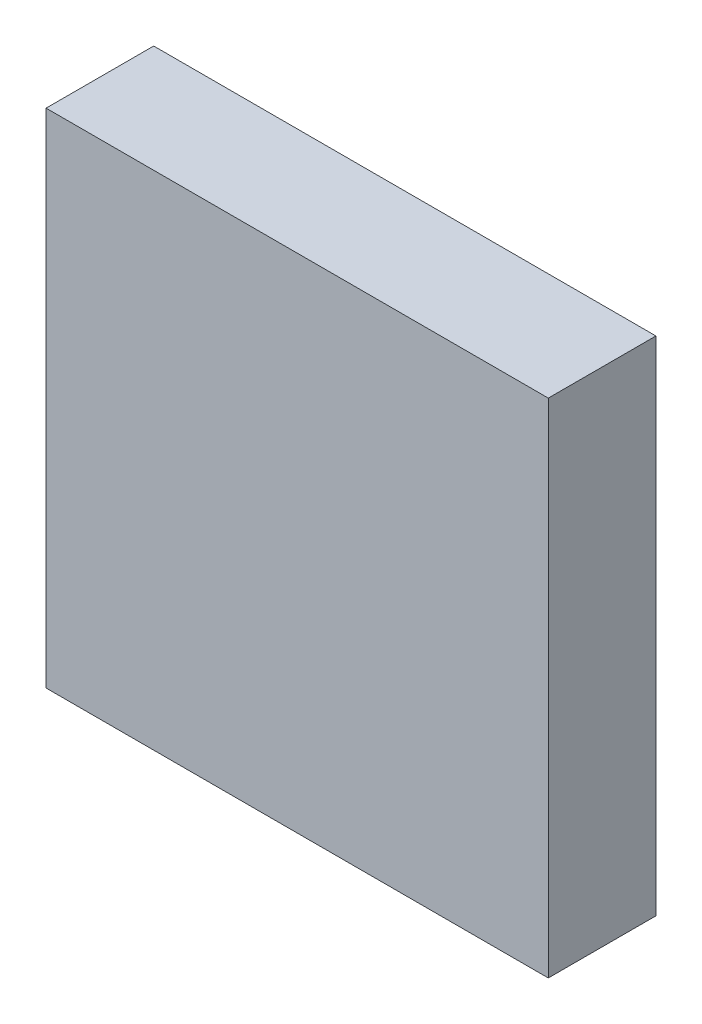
ISO-10303-21;
HEADER;
FILE_DESCRIPTION(('STEP AP214'),'2;1');
FILE_NAME('part.step','',(''),(''),'','','');
FILE_SCHEMA(('AUTOMOTIVE_DESIGN { 1 0 10303 214 1 1 1 1 }'));
ENDSEC;
DATA;
#1=APPLICATION_CONTEXT('core data for automotive mechanical design processes');
#2=APPLICATION_PROTOCOL_DEFINITION('international standard','automotive_design',2000,#1);
#3=PRODUCT_CONTEXT('',#1,'mechanical');
#4=PRODUCT('Part','Part','',(#3));
#5=PRODUCT_RELATED_PRODUCT_CATEGORY('part','',(#4));
#6=PRODUCT_DEFINITION_FORMATION('','',#4);
#7=PRODUCT_DEFINITION_CONTEXT('part definition',#1,'design');
#8=PRODUCT_DEFINITION('design','',#6,#7);
#9=PRODUCT_DEFINITION_SHAPE('','',#8);
#10=(LENGTH_UNIT() NAMED_UNIT(*) SI_UNIT(.MILLI.,.METRE.));
#11=(NAMED_UNIT(*) PLANE_ANGLE_UNIT() SI_UNIT($,.RADIAN.));
#12=(NAMED_UNIT(*) SI_UNIT($,.STERADIAN.) SOLID_ANGLE_UNIT());
#13=UNCERTAINTY_MEASURE_WITH_UNIT(LENGTH_MEASURE(1.E-05),#10,'distance_accuracy_value','');
#14=(GEOMETRIC_REPRESENTATION_CONTEXT(3) GLOBAL_UNCERTAINTY_ASSIGNED_CONTEXT((#13)) GLOBAL_UNIT_ASSIGNED_CONTEXT((#10,
#11,#12)) REPRESENTATION_CONTEXT('',''));
#15=CARTESIAN_POINT('',(0.,0.,0.));
#16=DIRECTION('',(0.,0.,1.));
#17=DIRECTION('',(1.,0.,0.));
#18=AXIS2_PLACEMENT_3D('',#15,#16,#17);
#19=CARTESIAN_POINT('',(-7.,7.,3.));
#20=DIRECTION('',(1.,0.,0.));
#21=DIRECTION('',(0.,1.,0.));
#22=AXIS2_PLACEMENT_3D('',#19,#20,#21);
#23=PLANE('',#22);
#24=DIRECTION('',(0.,-1.,0.));
#25=VECTOR('',#24,1.);
#26=CARTESIAN_POINT('',(-7.,7.,0.));
#27=LINE('',#26,#25);
#28=CARTESIAN_POINT('',(-7.,7.,0.));
#29=VERTEX_POINT('',#28);
#30=CARTESIAN_POINT('',(-7.,-7.,0.));
#31=VERTEX_POINT('',#30);
#32=EDGE_CURVE('E76',#29,#31,#27,.T.);
#33=ORIENTED_EDGE('',*,*,#32,.T.);
#34=DIRECTION('',(0.,0.,-1.));
#35=VECTOR('',#34,1.);
#36=CARTESIAN_POINT('',(-7.,-7.,3.));
#37=LINE('',#36,#35);
#38=CARTESIAN_POINT('',(-7.,-7.,3.));
#39=VERTEX_POINT('',#38);
#40=EDGE_CURVE('E11',#39,#31,#37,.T.);
#41=ORIENTED_EDGE('',*,*,#40,.F.);
#42=DIRECTION('',(0.,-1.,0.));
#43=VECTOR('',#42,1.);
#44=CARTESIAN_POINT('',(-7.,7.,3.));
#45=LINE('',#44,#43);
#46=CARTESIAN_POINT('',(-7.,7.,3.));
#47=VERTEX_POINT('',#46);
#48=EDGE_CURVE('E94',#47,#39,#45,.T.);
#49=ORIENTED_EDGE('',*,*,#48,.F.);
#50=DIRECTION('',(0.,0.,-1.));
#51=VECTOR('',#50,1.);
#52=CARTESIAN_POINT('',(-7.,7.,3.));
#53=LINE('',#52,#51);
#54=EDGE_CURVE('E88',#47,#29,#53,.T.);
#55=ORIENTED_EDGE('',*,*,#54,.T.);
#56=EDGE_LOOP('',(#33,#41,#49,#55));
#57=FACE_BOUND('',#56,.T.);
#58=ADVANCED_FACE('F32',(#57),#23,.F.);
#59=CARTESIAN_POINT('',(-7.,-7.,3.));
#60=DIRECTION('',(0.,1.,0.));
#61=DIRECTION('',(0.,0.,1.));
#62=AXIS2_PLACEMENT_3D('',#59,#60,#61);
#63=PLANE('',#62);
#64=DIRECTION('',(1.,0.,0.));
#65=VECTOR('',#64,1.);
#66=CARTESIAN_POINT('',(-7.,-7.,0.));
#67=LINE('',#66,#65);
#68=CARTESIAN_POINT('',(7.,-7.,0.));
#69=VERTEX_POINT('',#68);
#70=EDGE_CURVE('E72',#31,#69,#67,.T.);
#71=ORIENTED_EDGE('',*,*,#70,.T.);
#72=DIRECTION('',(0.,0.,-1.));
#73=VECTOR('',#72,1.);
#74=CARTESIAN_POINT('',(7.,-7.,3.));
#75=LINE('',#74,#73);
#76=CARTESIAN_POINT('',(7.,-7.,3.));
#77=VERTEX_POINT('',#76);
#78=EDGE_CURVE('E39',#77,#69,#75,.T.);
#79=ORIENTED_EDGE('',*,*,#78,.F.);
#80=DIRECTION('',(1.,0.,0.));
#81=VECTOR('',#80,1.);
#82=CARTESIAN_POINT('',(-7.,-7.,3.));
#83=LINE('',#82,#81);
#84=EDGE_CURVE('E84',#39,#77,#83,.T.);
#85=ORIENTED_EDGE('',*,*,#84,.F.);
#86=ORIENTED_EDGE('',*,*,#40,.T.);
#87=EDGE_LOOP('',(#71,#79,#85,#86));
#88=FACE_BOUND('',#87,.T.);
#89=ADVANCED_FACE('F83',(#88),#63,.F.);
#90=CARTESIAN_POINT('',(7.,7.,3.));
#91=DIRECTION('',(-1.,0.,0.));
#92=DIRECTION('',(0.,-1.,0.));
#93=AXIS2_PLACEMENT_3D('',#90,#91,#92);
#94=PLANE('',#93);
#95=DIRECTION('',(0.,1.,0.));
#96=VECTOR('',#95,1.);
#97=CARTESIAN_POINT('',(7.,7.,0.));
#98=LINE('',#97,#96);
#99=CARTESIAN_POINT('',(7.,7.,0.));
#100=VERTEX_POINT('',#99);
#101=EDGE_CURVE('E77',#69,#100,#98,.T.);
#102=ORIENTED_EDGE('',*,*,#101,.T.);
#103=DIRECTION('',(0.,0.,-1.));
#104=VECTOR('',#103,1.);
#105=CARTESIAN_POINT('',(7.,7.,3.));
#106=LINE('',#105,#104);
#107=CARTESIAN_POINT('',(7.,7.,3.));
#108=VERTEX_POINT('',#107);
#109=EDGE_CURVE('E100',#108,#100,#106,.T.);
#110=ORIENTED_EDGE('',*,*,#109,.F.);
#111=DIRECTION('',(0.,1.,0.));
#112=VECTOR('',#111,1.);
#113=CARTESIAN_POINT('',(7.,7.,3.));
#114=LINE('',#113,#112);
#115=EDGE_CURVE('E51',#77,#108,#114,.T.);
#116=ORIENTED_EDGE('',*,*,#115,.F.);
#117=ORIENTED_EDGE('',*,*,#78,.T.);
#118=EDGE_LOOP('',(#102,#110,#116,#117));
#119=FACE_BOUND('',#118,.T.);
#120=ADVANCED_FACE('F103',(#119),#94,.F.);
#121=CARTESIAN_POINT('',(-7.,7.,3.));
#122=DIRECTION('',(0.,-1.,0.));
#123=DIRECTION('',(1.,0.,0.));
#124=AXIS2_PLACEMENT_3D('',#121,#122,#123);
#125=PLANE('',#124);
#126=DIRECTION('',(-1.,0.,0.));
#127=VECTOR('',#126,1.);
#128=CARTESIAN_POINT('',(-7.,7.,0.));
#129=LINE('',#128,#127);
#130=EDGE_CURVE('E92',#100,#29,#129,.T.);
#131=ORIENTED_EDGE('',*,*,#130,.T.);
#132=ORIENTED_EDGE('',*,*,#54,.F.);
#133=DIRECTION('',(-1.,0.,0.));
#134=VECTOR('',#133,1.);
#135=CARTESIAN_POINT('',(-7.,7.,3.));
#136=LINE('',#135,#134);
#137=EDGE_CURVE('E46',#108,#47,#136,.T.);
#138=ORIENTED_EDGE('',*,*,#137,.F.);
#139=ORIENTED_EDGE('',*,*,#109,.T.);
#140=EDGE_LOOP('',(#131,#132,#138,#139));
#141=FACE_BOUND('',#140,.T.);
#142=ADVANCED_FACE('F105',(#141),#125,.F.);
#143=CARTESIAN_POINT('',(-7.,-7.,3.));
#144=DIRECTION('',(0.,0.,1.));
#145=DIRECTION('',(1.,0.,0.));
#146=AXIS2_PLACEMENT_3D('',#143,#144,#145);
#147=PLANE('',#146);
#148=ORIENTED_EDGE('',*,*,#48,.T.);
#149=ORIENTED_EDGE('',*,*,#84,.T.);
#150=ORIENTED_EDGE('',*,*,#115,.T.);
#151=ORIENTED_EDGE('',*,*,#137,.T.);
#152=EDGE_LOOP('',(#148,#149,#150,#151));
#153=FACE_BOUND('',#152,.T.);
#154=ADVANCED_FACE('F106',(#153),#147,.T.);
#155=CARTESIAN_POINT('',(-7.,-7.,0.));
#156=DIRECTION('',(0.,0.,1.));
#157=DIRECTION('',(1.,0.,0.));
#158=AXIS2_PLACEMENT_3D('',#155,#156,#157);
#159=PLANE('',#158);
#160=ORIENTED_EDGE('',*,*,#32,.F.);
#161=ORIENTED_EDGE('',*,*,#130,.F.);
#162=ORIENTED_EDGE('',*,*,#101,.F.);
#163=ORIENTED_EDGE('',*,*,#70,.F.);
#164=EDGE_LOOP('',(#160,#161,#162,#163));
#165=FACE_BOUND('',#164,.T.);
#166=ADVANCED_FACE('F73',(#165),#159,.F.);
#167=CLOSED_SHELL('',(#58,#89,#120,#142,#154,#166));
#168=MANIFOLD_SOLID_BREP('B2',#167);
#169=ADVANCED_BREP_SHAPE_REPRESENTATION('',(#18,#168),#14);
#170=SHAPE_DEFINITION_REPRESENTATION(#9,#169);
ENDSEC;
END-ISO-10303-21;
